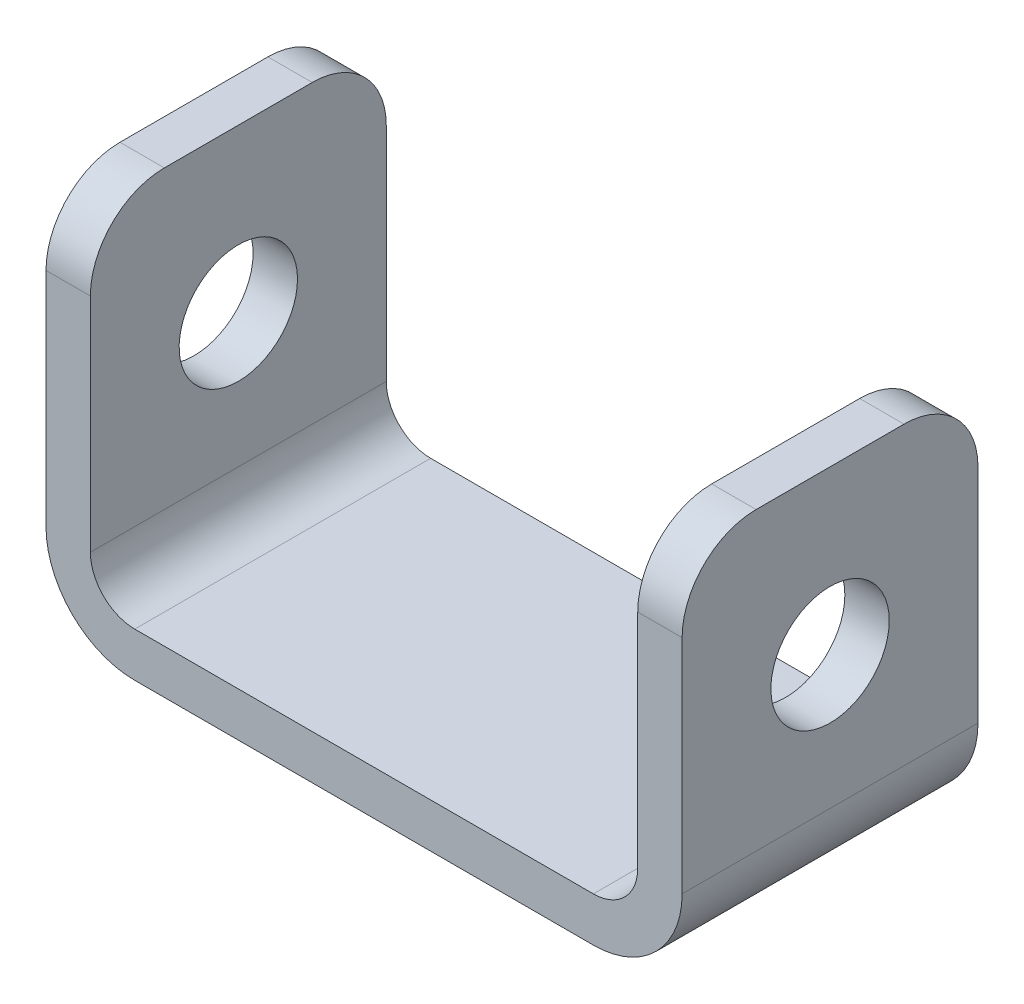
ISO-10303-21;
HEADER;
FILE_DESCRIPTION(('STEP AP214'),'2;1');
FILE_NAME('part.step','',(''),(''),'','','');
FILE_SCHEMA(('AUTOMOTIVE_DESIGN { 1 0 10303 214 1 1 1 1 }'));
ENDSEC;
DATA;
#1=APPLICATION_CONTEXT('core data for automotive mechanical design processes');
#2=APPLICATION_PROTOCOL_DEFINITION('international standard','automotive_design',2000,#1);
#3=PRODUCT_CONTEXT('',#1,'mechanical');
#4=PRODUCT('Part','Part','',(#3));
#5=PRODUCT_RELATED_PRODUCT_CATEGORY('part','',(#4));
#6=PRODUCT_DEFINITION_FORMATION('','',#4);
#7=PRODUCT_DEFINITION_CONTEXT('part definition',#1,'design');
#8=PRODUCT_DEFINITION('design','',#6,#7);
#9=PRODUCT_DEFINITION_SHAPE('','',#8);
#10=(LENGTH_UNIT() NAMED_UNIT(*) SI_UNIT(.MILLI.,.METRE.));
#11=(NAMED_UNIT(*) PLANE_ANGLE_UNIT() SI_UNIT($,.RADIAN.));
#12=(NAMED_UNIT(*) SI_UNIT($,.STERADIAN.) SOLID_ANGLE_UNIT());
#13=UNCERTAINTY_MEASURE_WITH_UNIT(LENGTH_MEASURE(1.E-05),#10,'distance_accuracy_value','');
#14=(GEOMETRIC_REPRESENTATION_CONTEXT(3) GLOBAL_UNCERTAINTY_ASSIGNED_CONTEXT((#13)) GLOBAL_UNIT_ASSIGNED_CONTEXT((#10,
#11,#12)) REPRESENTATION_CONTEXT('',''));
#15=CARTESIAN_POINT('',(0.,0.,0.));
#16=DIRECTION('',(0.,0.,1.));
#17=DIRECTION('',(1.,0.,0.));
#18=AXIS2_PLACEMENT_3D('',#15,#16,#17);
#19=CARTESIAN_POINT('',(-18.5,26.,10.));
#20=DIRECTION('',(0.,-1.,0.));
#21=DIRECTION('',(0.,0.,-1.));
#22=AXIS2_PLACEMENT_3D('',#19,#20,#21);
#23=PLANE('',#22);
#24=DIRECTION('',(0.,0.,-1.));
#25=VECTOR('',#24,1.);
#26=CARTESIAN_POINT('',(-21.5,26.,10.));
#27=LINE('',#26,#25);
#28=CARTESIAN_POINT('',(-21.5,26.,5.));
#29=VERTEX_POINT('',#28);
#30=CARTESIAN_POINT('',(-21.5,26.,-5.));
#31=VERTEX_POINT('',#30);
#32=EDGE_CURVE('E154',#29,#31,#27,.T.);
#33=ORIENTED_EDGE('',*,*,#32,.F.);
#34=DIRECTION('',(-1.,0.,0.));
#35=VECTOR('',#34,1.);
#36=CARTESIAN_POINT('',(-18.5,26.,5.));
#37=LINE('',#36,#35);
#38=CARTESIAN_POINT('',(-18.5,26.,5.));
#39=VERTEX_POINT('',#38);
#40=EDGE_CURVE('E250',#29,#39,#37,.F.);
#41=ORIENTED_EDGE('',*,*,#40,.T.);
#42=DIRECTION('',(0.,0.,-1.));
#43=VECTOR('',#42,1.);
#44=CARTESIAN_POINT('',(-18.5,26.,10.));
#45=LINE('',#44,#43);
#46=CARTESIAN_POINT('',(-18.5,26.,-5.));
#47=VERTEX_POINT('',#46);
#48=EDGE_CURVE('E213',#39,#47,#45,.T.);
#49=ORIENTED_EDGE('',*,*,#48,.T.);
#50=DIRECTION('',(-1.,0.,0.));
#51=VECTOR('',#50,1.);
#52=CARTESIAN_POINT('',(-18.5,26.,-5.));
#53=LINE('',#52,#51);
#54=EDGE_CURVE('E247',#47,#31,#53,.T.);
#55=ORIENTED_EDGE('',*,*,#54,.T.);
#56=EDGE_LOOP('',(#33,#41,#49,#55));
#57=FACE_BOUND('',#56,.T.);
#58=ADVANCED_FACE('F30',(#57),#23,.F.);
#59=CARTESIAN_POINT('',(-21.5,6.,10.));
#60=DIRECTION('',(-1.,0.,0.));
#61=DIRECTION('',(0.,0.,1.));
#62=AXIS2_PLACEMENT_3D('',#59,#60,#61);
#63=PLANE('',#62);
#64=CARTESIAN_POINT('',(-21.5,15.,0.));
#65=DIRECTION('',(1.,0.,0.));
#66=DIRECTION('',(0.,0.,-1.));
#67=AXIS2_PLACEMENT_3D('',#64,#65,#66);
#68=CIRCLE('',#67,4.);
#69=CARTESIAN_POINT('',(-21.5,15.,-4.));
#70=VERTEX_POINT('',#69);
#71=EDGE_CURVE('E341',#70,#70,#68,.T.);
#72=ORIENTED_EDGE('',*,*,#71,.T.);
#73=EDGE_LOOP('',(#72));
#74=FACE_BOUND('',#73,.T.);
#75=DIRECTION('',(0.,1.,0.));
#76=VECTOR('',#75,1.);
#77=CARTESIAN_POINT('',(-21.5,6.,10.));
#78=LINE('',#77,#76);
#79=CARTESIAN_POINT('',(-21.5,6.,10.));
#80=VERTEX_POINT('',#79);
#81=CARTESIAN_POINT('',(-21.5,21.,10.));
#82=VERTEX_POINT('',#81);
#83=EDGE_CURVE('E190',#80,#82,#78,.T.);
#84=ORIENTED_EDGE('',*,*,#83,.T.);
#85=CARTESIAN_POINT('',(-21.5,21.,5.));
#86=DIRECTION('',(-1.,0.,0.));
#87=DIRECTION('',(0.,0.,1.));
#88=AXIS2_PLACEMENT_3D('',#85,#86,#87);
#89=CIRCLE('',#88,5.);
#90=EDGE_CURVE('E245',#82,#29,#89,.T.);
#91=ORIENTED_EDGE('',*,*,#90,.T.);
#92=ORIENTED_EDGE('',*,*,#32,.T.);
#93=CARTESIAN_POINT('',(-21.5,21.,-5.));
#94=DIRECTION('',(-1.,0.,0.));
#95=DIRECTION('',(0.,0.,1.));
#96=AXIS2_PLACEMENT_3D('',#93,#94,#95);
#97=CIRCLE('',#96,5.);
#98=CARTESIAN_POINT('',(-21.5,21.,-10.));
#99=VERTEX_POINT('',#98);
#100=EDGE_CURVE('E161',#31,#99,#97,.T.);
#101=ORIENTED_EDGE('',*,*,#100,.T.);
#102=DIRECTION('',(0.,1.,0.));
#103=VECTOR('',#102,1.);
#104=CARTESIAN_POINT('',(-21.5,6.,-10.));
#105=LINE('',#104,#103);
#106=CARTESIAN_POINT('',(-21.5,6.,-10.));
#107=VERTEX_POINT('',#106);
#108=EDGE_CURVE('E158',#107,#99,#105,.T.);
#109=ORIENTED_EDGE('',*,*,#108,.F.);
#110=DIRECTION('',(0.,0.,-1.));
#111=VECTOR('',#110,1.);
#112=CARTESIAN_POINT('',(-21.5,6.,10.));
#113=LINE('',#112,#111);
#114=EDGE_CURVE('E144',#80,#107,#113,.T.);
#115=ORIENTED_EDGE('',*,*,#114,.F.);
#116=EDGE_LOOP('',(#84,#91,#92,#101,#109,#115));
#117=FACE_BOUND('',#116,.T.);
#118=ADVANCED_FACE('F159',(#74,#117),#63,.T.);
#119=CARTESIAN_POINT('',(-15.5,6.,10.));
#120=DIRECTION('',(0.,0.,-1.));
#121=DIRECTION('',(-1.,0.,0.));
#122=AXIS2_PLACEMENT_3D('',#119,#120,#121);
#123=CYLINDRICAL_SURFACE('',#122,6.);
#124=CARTESIAN_POINT('',(-15.5,6.,-10.));
#125=DIRECTION('',(0.,0.,-1.));
#126=DIRECTION('',(-1.,0.,0.));
#127=AXIS2_PLACEMENT_3D('',#124,#125,#126);
#128=CIRCLE('',#127,6.);
#129=CARTESIAN_POINT('',(-15.5,0.,-10.));
#130=VERTEX_POINT('',#129);
#131=EDGE_CURVE('E148',#130,#107,#128,.T.);
#132=ORIENTED_EDGE('',*,*,#131,.F.);
#133=DIRECTION('',(0.,0.,-1.));
#134=VECTOR('',#133,1.);
#135=CARTESIAN_POINT('',(-15.5,0.,10.));
#136=LINE('',#135,#134);
#137=CARTESIAN_POINT('',(-15.5,0.,10.));
#138=VERTEX_POINT('',#137);
#139=EDGE_CURVE('E155',#138,#130,#136,.T.);
#140=ORIENTED_EDGE('',*,*,#139,.F.);
#141=CARTESIAN_POINT('',(-15.5,6.,10.));
#142=DIRECTION('',(0.,0.,-1.));
#143=DIRECTION('',(-1.,0.,0.));
#144=AXIS2_PLACEMENT_3D('',#141,#142,#143);
#145=CIRCLE('',#144,6.);
#146=EDGE_CURVE('E150',#138,#80,#145,.T.);
#147=ORIENTED_EDGE('',*,*,#146,.T.);
#148=ORIENTED_EDGE('',*,*,#114,.T.);
#149=EDGE_LOOP('',(#132,#140,#147,#148));
#150=FACE_BOUND('',#149,.T.);
#151=ADVANCED_FACE('F146',(#150),#123,.T.);
#152=CARTESIAN_POINT('',(-15.5,0.,10.));
#153=DIRECTION('',(0.,1.,0.));
#154=DIRECTION('',(0.,0.,1.));
#155=AXIS2_PLACEMENT_3D('',#152,#153,#154);
#156=PLANE('',#155);
#157=DIRECTION('',(1.,0.,0.));
#158=VECTOR('',#157,1.);
#159=CARTESIAN_POINT('',(-15.5,0.,-10.));
#160=LINE('',#159,#158);
#161=CARTESIAN_POINT('',(15.5,0.,-10.));
#162=VERTEX_POINT('',#161);
#163=EDGE_CURVE('E169',#130,#162,#160,.T.);
#164=ORIENTED_EDGE('',*,*,#163,.T.);
#165=DIRECTION('',(0.,0.,-1.));
#166=VECTOR('',#165,1.);
#167=CARTESIAN_POINT('',(15.5,0.,10.));
#168=LINE('',#167,#166);
#169=CARTESIAN_POINT('',(15.5,0.,10.));
#170=VERTEX_POINT('',#169);
#171=EDGE_CURVE('E234',#170,#162,#168,.T.);
#172=ORIENTED_EDGE('',*,*,#171,.F.);
#173=DIRECTION('',(1.,0.,0.));
#174=VECTOR('',#173,1.);
#175=CARTESIAN_POINT('',(-15.5,0.,10.));
#176=LINE('',#175,#174);
#177=EDGE_CURVE('E193',#138,#170,#176,.T.);
#178=ORIENTED_EDGE('',*,*,#177,.F.);
#179=ORIENTED_EDGE('',*,*,#139,.T.);
#180=EDGE_LOOP('',(#164,#172,#178,#179));
#181=FACE_BOUND('',#180,.T.);
#182=ADVANCED_FACE('F323',(#181),#156,.F.);
#183=CARTESIAN_POINT('',(15.5,6.,10.));
#184=DIRECTION('',(0.,0.,-1.));
#185=DIRECTION('',(-1.,0.,0.));
#186=AXIS2_PLACEMENT_3D('',#183,#184,#185);
#187=CYLINDRICAL_SURFACE('',#186,6.);
#188=CARTESIAN_POINT('',(15.5,6.,-10.));
#189=DIRECTION('',(0.,0.,-1.));
#190=DIRECTION('',(-1.,0.,0.));
#191=AXIS2_PLACEMENT_3D('',#188,#189,#190);
#192=CIRCLE('',#191,6.);
#193=CARTESIAN_POINT('',(21.5,6.,-10.));
#194=VERTEX_POINT('',#193);
#195=EDGE_CURVE('E171',#194,#162,#192,.T.);
#196=ORIENTED_EDGE('',*,*,#195,.F.);
#197=DIRECTION('',(0.,0.,-1.));
#198=VECTOR('',#197,1.);
#199=CARTESIAN_POINT('',(21.5,6.,10.));
#200=LINE('',#199,#198);
#201=CARTESIAN_POINT('',(21.5,6.,10.));
#202=VERTEX_POINT('',#201);
#203=EDGE_CURVE('E232',#202,#194,#200,.T.);
#204=ORIENTED_EDGE('',*,*,#203,.F.);
#205=CARTESIAN_POINT('',(15.5,6.,10.));
#206=DIRECTION('',(0.,0.,-1.));
#207=DIRECTION('',(-1.,0.,0.));
#208=AXIS2_PLACEMENT_3D('',#205,#206,#207);
#209=CIRCLE('',#208,6.);
#210=EDGE_CURVE('E195',#202,#170,#209,.T.);
#211=ORIENTED_EDGE('',*,*,#210,.T.);
#212=ORIENTED_EDGE('',*,*,#171,.T.);
#213=EDGE_LOOP('',(#196,#204,#211,#212));
#214=FACE_BOUND('',#213,.T.);
#215=ADVANCED_FACE('F319',(#214),#187,.T.);
#216=CARTESIAN_POINT('',(21.5,6.,10.));
#217=DIRECTION('',(-1.,0.,0.));
#218=DIRECTION('',(0.,0.,1.));
#219=AXIS2_PLACEMENT_3D('',#216,#217,#218);
#220=PLANE('',#219);
#221=CARTESIAN_POINT('',(21.5,15.,0.));
#222=DIRECTION('',(1.,0.,0.));
#223=DIRECTION('',(0.,0.,-1.));
#224=AXIS2_PLACEMENT_3D('',#221,#222,#223);
#225=CIRCLE('',#224,4.);
#226=CARTESIAN_POINT('',(21.5,15.,-4.));
#227=VERTEX_POINT('',#226);
#228=EDGE_CURVE('E343',#227,#227,#225,.T.);
#229=ORIENTED_EDGE('',*,*,#228,.F.);
#230=EDGE_LOOP('',(#229));
#231=FACE_BOUND('',#230,.T.);
#232=DIRECTION('',(0.,0.,-1.));
#233=VECTOR('',#232,1.);
#234=CARTESIAN_POINT('',(21.5,26.,10.));
#235=LINE('',#234,#233);
#236=CARTESIAN_POINT('',(21.5,26.,5.));
#237=VERTEX_POINT('',#236);
#238=CARTESIAN_POINT('',(21.5,26.,-5.));
#239=VERTEX_POINT('',#238);
#240=EDGE_CURVE('E230',#237,#239,#235,.T.);
#241=ORIENTED_EDGE('',*,*,#240,.F.);
#242=CARTESIAN_POINT('',(21.5,21.,5.));
#243=DIRECTION('',(-1.,0.,0.));
#244=DIRECTION('',(0.,0.,1.));
#245=AXIS2_PLACEMENT_3D('',#242,#243,#244);
#246=CIRCLE('',#245,5.);
#247=CARTESIAN_POINT('',(21.5,21.,10.));
#248=VERTEX_POINT('',#247);
#249=EDGE_CURVE('E266',#237,#248,#246,.F.);
#250=ORIENTED_EDGE('',*,*,#249,.T.);
#251=DIRECTION('',(0.,1.,0.));
#252=VECTOR('',#251,1.);
#253=CARTESIAN_POINT('',(21.5,6.,10.));
#254=LINE('',#253,#252);
#255=EDGE_CURVE('E198',#202,#248,#254,.T.);
#256=ORIENTED_EDGE('',*,*,#255,.F.);
#257=ORIENTED_EDGE('',*,*,#203,.T.);
#258=DIRECTION('',(0.,1.,0.));
#259=VECTOR('',#258,1.);
#260=CARTESIAN_POINT('',(21.5,6.,-10.));
#261=LINE('',#260,#259);
#262=CARTESIAN_POINT('',(21.5,21.,-10.));
#263=VERTEX_POINT('',#262);
#264=EDGE_CURVE('E176',#194,#263,#261,.T.);
#265=ORIENTED_EDGE('',*,*,#264,.T.);
#266=CARTESIAN_POINT('',(21.5,21.,-5.));
#267=DIRECTION('',(-1.,0.,0.));
#268=DIRECTION('',(0.,0.,1.));
#269=AXIS2_PLACEMENT_3D('',#266,#267,#268);
#270=CIRCLE('',#269,5.);
#271=EDGE_CURVE('E50',#263,#239,#270,.F.);
#272=ORIENTED_EDGE('',*,*,#271,.T.);
#273=EDGE_LOOP('',(#241,#250,#256,#257,#265,#272));
#274=FACE_BOUND('',#273,.T.);
#275=ADVANCED_FACE('F316',(#231,#274),#220,.F.);
#276=CARTESIAN_POINT('',(21.5,26.,10.));
#277=DIRECTION('',(0.,-1.,0.));
#278=DIRECTION('',(0.,0.,-1.));
#279=AXIS2_PLACEMENT_3D('',#276,#277,#278);
#280=PLANE('',#279);
#281=DIRECTION('',(0.,0.,-1.));
#282=VECTOR('',#281,1.);
#283=CARTESIAN_POINT('',(18.5,26.,10.));
#284=LINE('',#283,#282);
#285=CARTESIAN_POINT('',(18.5,26.,5.));
#286=VERTEX_POINT('',#285);
#287=CARTESIAN_POINT('',(18.5,26.,-5.));
#288=VERTEX_POINT('',#287);
#289=EDGE_CURVE('E227',#286,#288,#284,.T.);
#290=ORIENTED_EDGE('',*,*,#289,.F.);
#291=DIRECTION('',(-1.,0.,0.));
#292=VECTOR('',#291,1.);
#293=CARTESIAN_POINT('',(21.5,26.,5.));
#294=LINE('',#293,#292);
#295=EDGE_CURVE('E263',#286,#237,#294,.F.);
#296=ORIENTED_EDGE('',*,*,#295,.T.);
#297=ORIENTED_EDGE('',*,*,#240,.T.);
#298=DIRECTION('',(-1.,0.,0.));
#299=VECTOR('',#298,1.);
#300=CARTESIAN_POINT('',(21.5,26.,-5.));
#301=LINE('',#300,#299);
#302=EDGE_CURVE('E260',#239,#288,#301,.T.);
#303=ORIENTED_EDGE('',*,*,#302,.T.);
#304=EDGE_LOOP('',(#290,#296,#297,#303));
#305=FACE_BOUND('',#304,.T.);
#306=ADVANCED_FACE('F308',(#305),#280,.F.);
#307=CARTESIAN_POINT('',(18.5,26.,10.));
#308=DIRECTION('',(1.,0.,0.));
#309=DIRECTION('',(0.,1.,0.));
#310=AXIS2_PLACEMENT_3D('',#307,#308,#309);
#311=PLANE('',#310);
#312=CARTESIAN_POINT('',(18.5,15.,0.));
#313=DIRECTION('',(1.,0.,0.));
#314=DIRECTION('',(0.,1.,0.));
#315=AXIS2_PLACEMENT_3D('',#312,#313,#314);
#316=CIRCLE('',#315,4.);
#317=CARTESIAN_POINT('',(18.5,19.,0.));
#318=VERTEX_POINT('',#317);
#319=EDGE_CURVE('E163',#318,#318,#316,.T.);
#320=ORIENTED_EDGE('',*,*,#319,.T.);
#321=EDGE_LOOP('',(#320));
#322=FACE_BOUND('',#321,.T.);
#323=DIRECTION('',(0.,-1.,0.));
#324=VECTOR('',#323,1.);
#325=CARTESIAN_POINT('',(18.5,26.,10.));
#326=LINE('',#325,#324);
#327=CARTESIAN_POINT('',(18.5,21.,10.));
#328=VERTEX_POINT('',#327);
#329=CARTESIAN_POINT('',(18.5,6.,10.));
#330=VERTEX_POINT('',#329);
#331=EDGE_CURVE('E201',#328,#330,#326,.T.);
#332=ORIENTED_EDGE('',*,*,#331,.F.);
#333=CARTESIAN_POINT('',(18.5,21.,5.));
#334=DIRECTION('',(1.,0.,0.));
#335=DIRECTION('',(0.,1.,0.));
#336=AXIS2_PLACEMENT_3D('',#333,#334,#335);
#337=CIRCLE('',#336,5.);
#338=EDGE_CURVE('E258',#328,#286,#337,.F.);
#339=ORIENTED_EDGE('',*,*,#338,.T.);
#340=ORIENTED_EDGE('',*,*,#289,.T.);
#341=CARTESIAN_POINT('',(18.5,21.,-5.));
#342=DIRECTION('',(1.,0.,0.));
#343=DIRECTION('',(0.,1.,0.));
#344=AXIS2_PLACEMENT_3D('',#341,#342,#343);
#345=CIRCLE('',#344,5.);
#346=CARTESIAN_POINT('',(18.5,21.,-10.));
#347=VERTEX_POINT('',#346);
#348=EDGE_CURVE('E256',#288,#347,#345,.F.);
#349=ORIENTED_EDGE('',*,*,#348,.T.);
#350=DIRECTION('',(0.,-1.,0.));
#351=VECTOR('',#350,1.);
#352=CARTESIAN_POINT('',(18.5,26.,-10.));
#353=LINE('',#352,#351);
#354=CARTESIAN_POINT('',(18.5,6.,-10.));
#355=VERTEX_POINT('',#354);
#356=EDGE_CURVE('E178',#347,#355,#353,.T.);
#357=ORIENTED_EDGE('',*,*,#356,.T.);
#358=DIRECTION('',(0.,0.,-1.));
#359=VECTOR('',#358,1.);
#360=CARTESIAN_POINT('',(18.5,6.,10.));
#361=LINE('',#360,#359);
#362=EDGE_CURVE('E224',#330,#355,#361,.T.);
#363=ORIENTED_EDGE('',*,*,#362,.F.);
#364=EDGE_LOOP('',(#332,#339,#340,#349,#357,#363));
#365=FACE_BOUND('',#364,.T.);
#366=ADVANCED_FACE('F302',(#322,#365),#311,.F.);
#367=CARTESIAN_POINT('',(15.5,6.,10.));
#368=DIRECTION('',(0.,0.,-1.));
#369=DIRECTION('',(-1.,0.,0.));
#370=AXIS2_PLACEMENT_3D('',#367,#368,#369);
#371=CYLINDRICAL_SURFACE('',#370,3.);
#372=CARTESIAN_POINT('',(15.5,6.,-10.));
#373=DIRECTION('',(0.,0.,1.));
#374=DIRECTION('',(1.,0.,0.));
#375=AXIS2_PLACEMENT_3D('',#372,#373,#374);
#376=CIRCLE('',#375,3.);
#377=CARTESIAN_POINT('',(15.5,3.,-10.));
#378=VERTEX_POINT('',#377);
#379=EDGE_CURVE('E180',#378,#355,#376,.T.);
#380=ORIENTED_EDGE('',*,*,#379,.F.);
#381=DIRECTION('',(0.,0.,-1.));
#382=VECTOR('',#381,1.);
#383=CARTESIAN_POINT('',(15.5,3.,10.));
#384=LINE('',#383,#382);
#385=CARTESIAN_POINT('',(15.5,3.,10.));
#386=VERTEX_POINT('',#385);
#387=EDGE_CURVE('E222',#386,#378,#384,.T.);
#388=ORIENTED_EDGE('',*,*,#387,.F.);
#389=CARTESIAN_POINT('',(15.5,6.,10.));
#390=DIRECTION('',(0.,0.,1.));
#391=DIRECTION('',(1.,0.,0.));
#392=AXIS2_PLACEMENT_3D('',#389,#390,#391);
#393=CIRCLE('',#392,3.);
#394=EDGE_CURVE('E203',#386,#330,#393,.T.);
#395=ORIENTED_EDGE('',*,*,#394,.T.);
#396=ORIENTED_EDGE('',*,*,#362,.T.);
#397=EDGE_LOOP('',(#380,#388,#395,#396));
#398=FACE_BOUND('',#397,.T.);
#399=ADVANCED_FACE('F298',(#398),#371,.F.);
#400=CARTESIAN_POINT('',(15.5,3.,10.));
#401=DIRECTION('',(0.,-1.,0.));
#402=DIRECTION('',(1.,0.,0.));
#403=AXIS2_PLACEMENT_3D('',#400,#401,#402);
#404=PLANE('',#403);
#405=DIRECTION('',(-1.,0.,0.));
#406=VECTOR('',#405,1.);
#407=CARTESIAN_POINT('',(15.5,3.,-10.));
#408=LINE('',#407,#406);
#409=CARTESIAN_POINT('',(-15.5,3.,-10.));
#410=VERTEX_POINT('',#409);
#411=EDGE_CURVE('E183',#378,#410,#408,.T.);
#412=ORIENTED_EDGE('',*,*,#411,.T.);
#413=DIRECTION('',(0.,0.,-1.));
#414=VECTOR('',#413,1.);
#415=CARTESIAN_POINT('',(-15.5,3.,10.));
#416=LINE('',#415,#414);
#417=CARTESIAN_POINT('',(-15.5,3.,10.));
#418=VERTEX_POINT('',#417);
#419=EDGE_CURVE('E219',#418,#410,#416,.T.);
#420=ORIENTED_EDGE('',*,*,#419,.F.);
#421=DIRECTION('',(-1.,0.,0.));
#422=VECTOR('',#421,1.);
#423=CARTESIAN_POINT('',(15.5,3.,10.));
#424=LINE('',#423,#422);
#425=EDGE_CURVE('E206',#386,#418,#424,.T.);
#426=ORIENTED_EDGE('',*,*,#425,.F.);
#427=ORIENTED_EDGE('',*,*,#387,.T.);
#428=EDGE_LOOP('',(#412,#420,#426,#427));
#429=FACE_BOUND('',#428,.T.);
#430=ADVANCED_FACE('F378',(#429),#404,.F.);
#431=CARTESIAN_POINT('',(-15.5,6.,10.));
#432=DIRECTION('',(0.,0.,-1.));
#433=DIRECTION('',(-1.,0.,0.));
#434=AXIS2_PLACEMENT_3D('',#431,#432,#433);
#435=CYLINDRICAL_SURFACE('',#434,3.);
#436=CARTESIAN_POINT('',(-15.5,6.,-10.));
#437=DIRECTION('',(0.,0.,-1.));
#438=DIRECTION('',(-1.,0.,0.));
#439=AXIS2_PLACEMENT_3D('',#436,#437,#438);
#440=CIRCLE('',#439,3.);
#441=CARTESIAN_POINT('',(-18.5,6.,-10.));
#442=VERTEX_POINT('',#441);
#443=EDGE_CURVE('E185',#410,#442,#440,.T.);
#444=ORIENTED_EDGE('',*,*,#443,.T.);
#445=DIRECTION('',(0.,0.,-1.));
#446=VECTOR('',#445,1.);
#447=CARTESIAN_POINT('',(-18.5,6.,10.));
#448=LINE('',#447,#446);
#449=CARTESIAN_POINT('',(-18.5,6.,10.));
#450=VERTEX_POINT('',#449);
#451=EDGE_CURVE('E216',#450,#442,#448,.T.);
#452=ORIENTED_EDGE('',*,*,#451,.F.);
#453=CARTESIAN_POINT('',(-15.5,6.,10.));
#454=DIRECTION('',(0.,0.,-1.));
#455=DIRECTION('',(-1.,0.,0.));
#456=AXIS2_PLACEMENT_3D('',#453,#454,#455);
#457=CIRCLE('',#456,3.);
#458=EDGE_CURVE('E208',#418,#450,#457,.T.);
#459=ORIENTED_EDGE('',*,*,#458,.F.);
#460=ORIENTED_EDGE('',*,*,#419,.T.);
#461=EDGE_LOOP('',(#444,#452,#459,#460));
#462=FACE_BOUND('',#461,.T.);
#463=ADVANCED_FACE('F293',(#462),#435,.F.);
#464=CARTESIAN_POINT('',(-18.5,6.,10.));
#465=DIRECTION('',(-1.,0.,0.));
#466=DIRECTION('',(0.,-1.,0.));
#467=AXIS2_PLACEMENT_3D('',#464,#465,#466);
#468=PLANE('',#467);
#469=CARTESIAN_POINT('',(-18.5,15.,0.));
#470=DIRECTION('',(-1.,0.,0.));
#471=DIRECTION('',(0.,-1.,0.));
#472=AXIS2_PLACEMENT_3D('',#469,#470,#471);
#473=CIRCLE('',#472,4.);
#474=CARTESIAN_POINT('',(-18.5,11.,0.));
#475=VERTEX_POINT('',#474);
#476=EDGE_CURVE('E33',#475,#475,#473,.T.);
#477=ORIENTED_EDGE('',*,*,#476,.T.);
#478=EDGE_LOOP('',(#477));
#479=FACE_BOUND('',#478,.T.);
#480=ORIENTED_EDGE('',*,*,#48,.F.);
#481=CARTESIAN_POINT('',(-18.5,21.,5.));
#482=DIRECTION('',(-1.,0.,0.));
#483=DIRECTION('',(0.,-1.,0.));
#484=AXIS2_PLACEMENT_3D('',#481,#482,#483);
#485=CIRCLE('',#484,5.);
#486=CARTESIAN_POINT('',(-18.5,21.,10.));
#487=VERTEX_POINT('',#486);
#488=EDGE_CURVE('E254',#39,#487,#485,.F.);
#489=ORIENTED_EDGE('',*,*,#488,.T.);
#490=DIRECTION('',(0.,1.,0.));
#491=VECTOR('',#490,1.);
#492=CARTESIAN_POINT('',(-18.5,6.,10.));
#493=LINE('',#492,#491);
#494=EDGE_CURVE('E210',#450,#487,#493,.T.);
#495=ORIENTED_EDGE('',*,*,#494,.F.);
#496=ORIENTED_EDGE('',*,*,#451,.T.);
#497=DIRECTION('',(0.,1.,0.));
#498=VECTOR('',#497,1.);
#499=CARTESIAN_POINT('',(-18.5,6.,-10.));
#500=LINE('',#499,#498);
#501=CARTESIAN_POINT('',(-18.5,21.,-10.));
#502=VERTEX_POINT('',#501);
#503=EDGE_CURVE('E187',#442,#502,#500,.T.);
#504=ORIENTED_EDGE('',*,*,#503,.T.);
#505=CARTESIAN_POINT('',(-18.5,21.,-5.));
#506=DIRECTION('',(-1.,0.,0.));
#507=DIRECTION('',(0.,-1.,0.));
#508=AXIS2_PLACEMENT_3D('',#505,#506,#507);
#509=CIRCLE('',#508,5.);
#510=EDGE_CURVE('E252',#502,#47,#509,.F.);
#511=ORIENTED_EDGE('',*,*,#510,.T.);
#512=EDGE_LOOP('',(#480,#489,#495,#496,#504,#511));
#513=FACE_BOUND('',#512,.T.);
#514=ADVANCED_FACE('F274',(#479,#513),#468,.F.);
#515=CARTESIAN_POINT('',(-15.5,6.,10.));
#516=DIRECTION('',(0.,0.,-1.));
#517=DIRECTION('',(-1.,0.,0.));
#518=AXIS2_PLACEMENT_3D('',#515,#516,#517);
#519=PLANE('',#518);
#520=ORIENTED_EDGE('',*,*,#494,.T.);
#521=DIRECTION('',(-1.,0.,0.));
#522=VECTOR('',#521,1.);
#523=CARTESIAN_POINT('',(-15.5,21.,10.));
#524=LINE('',#523,#522);
#525=EDGE_CURVE('E241',#487,#82,#524,.T.);
#526=ORIENTED_EDGE('',*,*,#525,.T.);
#527=ORIENTED_EDGE('',*,*,#83,.F.);
#528=ORIENTED_EDGE('',*,*,#146,.F.);
#529=ORIENTED_EDGE('',*,*,#177,.T.);
#530=ORIENTED_EDGE('',*,*,#210,.F.);
#531=ORIENTED_EDGE('',*,*,#255,.T.);
#532=DIRECTION('',(-1.,0.,0.));
#533=VECTOR('',#532,1.);
#534=CARTESIAN_POINT('',(-15.5,21.,10.));
#535=LINE('',#534,#533);
#536=EDGE_CURVE('E238',#248,#328,#535,.T.);
#537=ORIENTED_EDGE('',*,*,#536,.T.);
#538=ORIENTED_EDGE('',*,*,#331,.T.);
#539=ORIENTED_EDGE('',*,*,#394,.F.);
#540=ORIENTED_EDGE('',*,*,#425,.T.);
#541=ORIENTED_EDGE('',*,*,#458,.T.);
#542=EDGE_LOOP('',(#520,#526,#527,#528,#529,#530,#531,#537,#538,#539,#540,#541));
#543=FACE_BOUND('',#542,.T.);
#544=ADVANCED_FACE('F287',(#543),#519,.F.);
#545=CARTESIAN_POINT('',(-15.5,6.,-10.));
#546=DIRECTION('',(0.,0.,-1.));
#547=DIRECTION('',(-1.,0.,0.));
#548=AXIS2_PLACEMENT_3D('',#545,#546,#547);
#549=PLANE('',#548);
#550=ORIENTED_EDGE('',*,*,#356,.F.);
#551=DIRECTION('',(-1.,0.,0.));
#552=VECTOR('',#551,1.);
#553=CARTESIAN_POINT('',(21.5,21.,-10.));
#554=LINE('',#553,#552);
#555=EDGE_CURVE('E11',#347,#263,#554,.F.);
#556=ORIENTED_EDGE('',*,*,#555,.T.);
#557=ORIENTED_EDGE('',*,*,#264,.F.);
#558=ORIENTED_EDGE('',*,*,#195,.T.);
#559=ORIENTED_EDGE('',*,*,#163,.F.);
#560=ORIENTED_EDGE('',*,*,#131,.T.);
#561=ORIENTED_EDGE('',*,*,#108,.T.);
#562=DIRECTION('',(-1.,0.,0.));
#563=VECTOR('',#562,1.);
#564=CARTESIAN_POINT('',(-18.5,21.,-10.));
#565=LINE('',#564,#563);
#566=EDGE_CURVE('E38',#99,#502,#565,.F.);
#567=ORIENTED_EDGE('',*,*,#566,.T.);
#568=ORIENTED_EDGE('',*,*,#503,.F.);
#569=ORIENTED_EDGE('',*,*,#443,.F.);
#570=ORIENTED_EDGE('',*,*,#411,.F.);
#571=ORIENTED_EDGE('',*,*,#379,.T.);
#572=EDGE_LOOP('',(#550,#556,#557,#558,#559,#560,#561,#567,#568,#569,#570,#571));
#573=FACE_BOUND('',#572,.T.);
#574=ADVANCED_FACE('F166',(#573),#549,.T.);
#575=CARTESIAN_POINT('',(-15.5,21.,5.));
#576=DIRECTION('',(-1.,0.,0.));
#577=DIRECTION('',(0.,0.,1.));
#578=AXIS2_PLACEMENT_3D('',#575,#576,#577);
#579=CYLINDRICAL_SURFACE('',#578,5.);
#580=ORIENTED_EDGE('',*,*,#488,.F.);
#581=ORIENTED_EDGE('',*,*,#40,.F.);
#582=ORIENTED_EDGE('',*,*,#90,.F.);
#583=ORIENTED_EDGE('',*,*,#525,.F.);
#584=EDGE_LOOP('',(#580,#581,#582,#583));
#585=FACE_BOUND('',#584,.T.);
#586=ADVANCED_FACE('F285',(#585),#579,.T.);
#587=CARTESIAN_POINT('',(-15.5,21.,5.));
#588=DIRECTION('',(-1.,0.,0.));
#589=DIRECTION('',(0.,0.,1.));
#590=AXIS2_PLACEMENT_3D('',#587,#588,#589);
#591=CYLINDRICAL_SURFACE('',#590,5.);
#592=ORIENTED_EDGE('',*,*,#249,.F.);
#593=ORIENTED_EDGE('',*,*,#295,.F.);
#594=ORIENTED_EDGE('',*,*,#338,.F.);
#595=ORIENTED_EDGE('',*,*,#536,.F.);
#596=EDGE_LOOP('',(#592,#593,#594,#595));
#597=FACE_BOUND('',#596,.T.);
#598=ADVANCED_FACE('F313',(#597),#591,.T.);
#599=CARTESIAN_POINT('',(21.5,21.,-5.));
#600=DIRECTION('',(1.,0.,0.));
#601=DIRECTION('',(0.,0.,-1.));
#602=AXIS2_PLACEMENT_3D('',#599,#600,#601);
#603=CYLINDRICAL_SURFACE('',#602,5.);
#604=ORIENTED_EDGE('',*,*,#271,.F.);
#605=ORIENTED_EDGE('',*,*,#555,.F.);
#606=ORIENTED_EDGE('',*,*,#348,.F.);
#607=ORIENTED_EDGE('',*,*,#302,.F.);
#608=EDGE_LOOP('',(#604,#605,#606,#607));
#609=FACE_BOUND('',#608,.T.);
#610=ADVANCED_FACE('F304',(#609),#603,.T.);
#611=CARTESIAN_POINT('',(-18.5,21.,-5.));
#612=DIRECTION('',(1.,0.,0.));
#613=DIRECTION('',(0.,0.,-1.));
#614=AXIS2_PLACEMENT_3D('',#611,#612,#613);
#615=CYLINDRICAL_SURFACE('',#614,5.);
#616=ORIENTED_EDGE('',*,*,#510,.F.);
#617=ORIENTED_EDGE('',*,*,#566,.F.);
#618=ORIENTED_EDGE('',*,*,#100,.F.);
#619=ORIENTED_EDGE('',*,*,#54,.F.);
#620=EDGE_LOOP('',(#616,#617,#618,#619));
#621=FACE_BOUND('',#620,.T.);
#622=ADVANCED_FACE('F278',(#621),#615,.T.);
#623=CARTESIAN_POINT('',(-21.5,15.,0.));
#624=DIRECTION('',(1.,0.,0.));
#625=DIRECTION('',(0.,0.,-1.));
#626=AXIS2_PLACEMENT_3D('',#623,#624,#625);
#627=CYLINDRICAL_SURFACE('',#626,4.);
#628=ORIENTED_EDGE('',*,*,#71,.F.);
#629=EDGE_LOOP('',(#628));
#630=FACE_BOUND('',#629,.T.);
#631=ORIENTED_EDGE('',*,*,#476,.F.);
#632=EDGE_LOOP('',(#631));
#633=FACE_BOUND('',#632,.T.);
#634=ADVANCED_FACE('F354',(#630,#633),#627,.F.);
#635=ORIENTED_EDGE('',*,*,#228,.T.);
#636=EDGE_LOOP('',(#635));
#637=FACE_BOUND('',#636,.T.);
#638=ORIENTED_EDGE('',*,*,#319,.F.);
#639=EDGE_LOOP('',(#638));
#640=FACE_BOUND('',#639,.T.);
#641=ADVANCED_FACE('F352',(#637,#640),#627,.F.);
#642=CLOSED_SHELL('',(#58,#118,#151,#182,#215,#275,#306,#366,#399,#430,#463,#514,#544,#574,#586,
#598,#610,#622,#634,#641));
#643=MANIFOLD_SOLID_BREP('B2',#642);
#644=ADVANCED_BREP_SHAPE_REPRESENTATION('',(#18,#643),#14);
#645=SHAPE_DEFINITION_REPRESENTATION(#9,#644);
ENDSEC;
END-ISO-10303-21;
